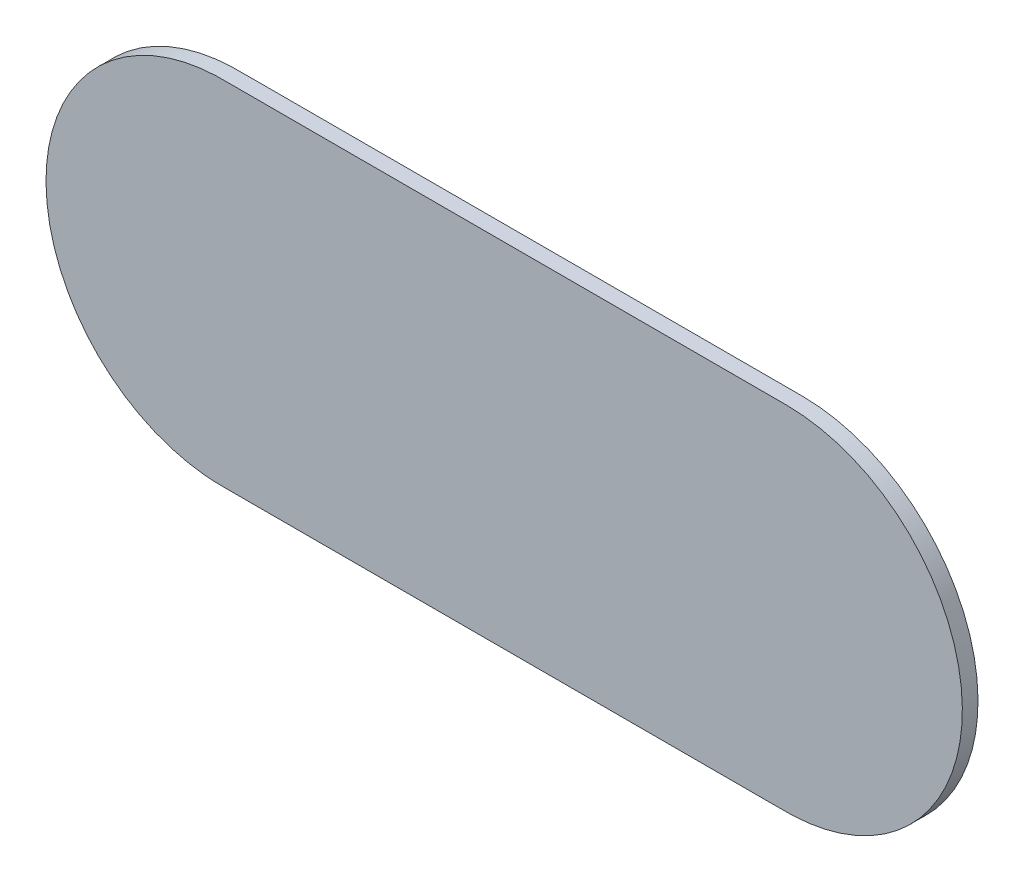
ISO-10303-21;
HEADER;
FILE_DESCRIPTION(('STEP AP214'),'2;1');
FILE_NAME('part.step','',(''),(''),'','','');
FILE_SCHEMA(('AUTOMOTIVE_DESIGN { 1 0 10303 214 1 1 1 1 }'));
ENDSEC;
DATA;
#1=APPLICATION_CONTEXT('core data for automotive mechanical design processes');
#2=APPLICATION_PROTOCOL_DEFINITION('international standard','automotive_design',2000,#1);
#3=PRODUCT_CONTEXT('',#1,'mechanical');
#4=PRODUCT('Part','Part','',(#3));
#5=PRODUCT_RELATED_PRODUCT_CATEGORY('part','',(#4));
#6=PRODUCT_DEFINITION_FORMATION('','',#4);
#7=PRODUCT_DEFINITION_CONTEXT('part definition',#1,'design');
#8=PRODUCT_DEFINITION('design','',#6,#7);
#9=PRODUCT_DEFINITION_SHAPE('','',#8);
#10=(LENGTH_UNIT() NAMED_UNIT(*) SI_UNIT(.MILLI.,.METRE.));
#11=(NAMED_UNIT(*) PLANE_ANGLE_UNIT() SI_UNIT($,.RADIAN.));
#12=(NAMED_UNIT(*) SI_UNIT($,.STERADIAN.) SOLID_ANGLE_UNIT());
#13=UNCERTAINTY_MEASURE_WITH_UNIT(LENGTH_MEASURE(1.E-05),#10,'distance_accuracy_value','');
#14=(GEOMETRIC_REPRESENTATION_CONTEXT(3) GLOBAL_UNCERTAINTY_ASSIGNED_CONTEXT((#13)) GLOBAL_UNIT_ASSIGNED_CONTEXT((#10,
#11,#12)) REPRESENTATION_CONTEXT('',''));
#15=CARTESIAN_POINT('',(0.,0.,0.));
#16=DIRECTION('',(0.,0.,1.));
#17=DIRECTION('',(1.,0.,0.));
#18=AXIS2_PLACEMENT_3D('',#15,#16,#17);
#19=CARTESIAN_POINT('',(457.2,0.,0.));
#20=DIRECTION('',(0.,0.,1.));
#21=DIRECTION('',(1.,0.,0.));
#22=AXIS2_PLACEMENT_3D('',#19,#20,#21);
#23=PLANE('',#22);
#24=CARTESIAN_POINT('',(0.659988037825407,-142.875,0.));
#25=CARTESIAN_POINT('',(152.619996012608,-142.875,0.));
#26=CARTESIAN_POINT('',(304.580003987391,-142.875,0.));
#27=CARTESIAN_POINT('',(456.540011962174,-142.875,0.));
#28=CARTESIAN_POINT('',(456.613343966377,-142.875,0.));
#29=CARTESIAN_POINT('',(456.760007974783,-142.875,0.));
#30=CARTESIAN_POINT('',(456.980003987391,-142.875,0.));
#31=CARTESIAN_POINT('',(457.126667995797,-142.875,0.));
#32=CARTESIAN_POINT('',(457.2,-142.875,0.));
#33=CARTESIAN_POINT('',(457.27199346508,-142.875,0.));
#34=CARTESIAN_POINT('',(457.41598039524,-142.875,0.));
#35=CARTESIAN_POINT('',(457.631960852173,-142.874401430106,0.));
#36=CARTESIAN_POINT('',(457.775946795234,-142.873857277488,0.));
#37=CARTESIAN_POINT('',(457.84793951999,-142.873530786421,0.));
#38=CARTESIAN_POINT('',(741.023653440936,-141.589312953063,0.));
#39=CARTESIAN_POINT('',(741.023653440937,141.589312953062,0.));
#40=CARTESIAN_POINT('',(457.84793951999,142.873530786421,0.));
#41=CARTESIAN_POINT('',(457.775946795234,142.873857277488,0.));
#42=CARTESIAN_POINT('',(457.631960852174,142.874401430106,0.));
#43=CARTESIAN_POINT('',(457.41598039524,142.875,0.));
#44=CARTESIAN_POINT('',(457.27199346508,142.875,0.));
#45=CARTESIAN_POINT('',(457.2,142.875,0.));
#46=CARTESIAN_POINT('',(457.126667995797,142.875,0.));
#47=CARTESIAN_POINT('',(456.980003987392,142.875,0.));
#48=CARTESIAN_POINT('',(456.760007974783,142.875,0.));
#49=CARTESIAN_POINT('',(456.613343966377,142.875,0.));
#50=CARTESIAN_POINT('',(456.540011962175,142.875,0.));
#51=CARTESIAN_POINT('',(304.580003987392,142.875,0.));
#52=CARTESIAN_POINT('',(152.619996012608,142.875,0.));
#53=CARTESIAN_POINT('',(0.65998803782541,142.875,0.));
#54=CARTESIAN_POINT('',(0.586656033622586,142.875,0.));
#55=CARTESIAN_POINT('',(0.43999202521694,142.875,0.));
#56=CARTESIAN_POINT('',(0.21999601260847,142.875,0.));
#57=CARTESIAN_POINT('',(0.073332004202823,142.875,0.));
#58=CARTESIAN_POINT('',(0.,142.875,0.));
#59=CARTESIAN_POINT('',(-0.0719934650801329,142.875,0.));
#60=CARTESIAN_POINT('',(-0.215980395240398,142.875,0.));
#61=CARTESIAN_POINT('',(-0.431960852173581,142.874401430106,0.));
#62=CARTESIAN_POINT('',(-0.575946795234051,142.873857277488,0.));
#63=CARTESIAN_POINT('',(-0.647939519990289,142.873530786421,0.));
#64=CARTESIAN_POINT('',(-283.823653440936,141.589312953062,0.));
#65=CARTESIAN_POINT('',(-283.823653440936,-141.589312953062,0.));
#66=CARTESIAN_POINT('',(-0.647939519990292,-142.873530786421,0.));
#67=CARTESIAN_POINT('',(-0.575946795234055,-142.873857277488,0.));
#68=CARTESIAN_POINT('',(-0.431960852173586,-142.874401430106,0.));
#69=CARTESIAN_POINT('',(-0.215980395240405,-142.875,0.));
#70=CARTESIAN_POINT('',(-0.0719934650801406,-142.875,0.));
#71=CARTESIAN_POINT('',(0.,-142.875,0.));
#72=CARTESIAN_POINT('',(0.0733320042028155,-142.875,0.));
#73=CARTESIAN_POINT('',(0.219996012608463,-142.875,0.));
#74=CARTESIAN_POINT('',(0.439992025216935,-142.875,0.));
#75=CARTESIAN_POINT('',(0.586656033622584,-142.875,0.));
#76=CARTESIAN_POINT('',(0.659988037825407,-142.875,0.));
#77=(BOUNDED_CURVE() B_SPLINE_CURVE(3,(#24,#25,#26,#27,#28,#29,#30,#31,#32,#33,#34,#35,#36,#37,
#38,#39,#40,#41,#42,#43,#44,#45,#46,#47,#48,#49,#50,#51,#52,#53,#54,#55,#56,#57,#58,#59,#60,#61,
#62,#63,#64,#65,#66,#67,#68,#69,#70,#71,#72,#73,#74,#75,#76),.UNSPECIFIED.,.T.,
.F.) B_SPLINE_CURVE_WITH_KNOTS((4,3,1,1,3,1,1,3,3,1,1,3,1,1,3,3,1,1,3,1,1,3,3,1,1,3,1,1,4),(0.,
0.306270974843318,0.306418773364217,0.306566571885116,0.306714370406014,0.306859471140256,
0.307004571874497,0.307149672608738,0.499121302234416,0.499266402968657,0.499411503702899,
0.49955660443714,0.499704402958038,0.499852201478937,0.499999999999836,0.806270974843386,
0.806418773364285,0.806566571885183,0.806714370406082,0.806859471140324,0.807004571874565,
0.807149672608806,0.99912130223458,0.999266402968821,0.999411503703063,0.999556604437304,
0.999704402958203,0.999852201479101,1.),
.UNSPECIFIED.) CURVE() GEOMETRIC_REPRESENTATION_ITEM() RATIONAL_B_SPLINE_CURVE((1.,1.,1.,1.,1.,
1.,1.,1.,1.,1.,1.,1.,1.,1.,0.336356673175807,0.336356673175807,1.,1.,1.,1.,1.,1.,1.,1.,1.,1.,1.,
1.,1.,1.,1.,1.,1.,1.,1.,1.,1.,1.,1.,1.,0.336356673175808,0.336356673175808,1.,1.,1.,1.,1.,1.,1.,
1.,1.,1.,1.)) REPRESENTATION_ITEM(''));
#78=CARTESIAN_POINT('',(0.659988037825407,-142.875,0.));
#79=VERTEX_POINT('',#78);
#80=EDGE_CURVE('E11',#79,#79,#77,.F.);
#81=ORIENTED_EDGE('',*,*,#80,.F.);
#82=EDGE_LOOP('',(#81));
#83=FACE_BOUND('',#82,.T.);
#84=ADVANCED_FACE('F31',(#83),#23,.T.);
#85=CARTESIAN_POINT('',(0.659988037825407,-142.875,2.54));
#86=CARTESIAN_POINT('',(152.619996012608,-142.875,2.54));
#87=CARTESIAN_POINT('',(304.580003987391,-142.875,2.54));
#88=CARTESIAN_POINT('',(456.540011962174,-142.875,2.54));
#89=CARTESIAN_POINT('',(456.613343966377,-142.875,2.54));
#90=CARTESIAN_POINT('',(456.760007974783,-142.875,2.54));
#91=CARTESIAN_POINT('',(456.980003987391,-142.875,2.54));
#92=CARTESIAN_POINT('',(457.126667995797,-142.875,2.54));
#93=CARTESIAN_POINT('',(457.2,-142.875,2.54));
#94=CARTESIAN_POINT('',(457.27199346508,-142.875,2.54));
#95=CARTESIAN_POINT('',(457.41598039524,-142.875,2.54));
#96=CARTESIAN_POINT('',(457.631960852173,-142.874401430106,2.54));
#97=CARTESIAN_POINT('',(457.775946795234,-142.873857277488,2.54));
#98=CARTESIAN_POINT('',(457.84793951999,-142.873530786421,2.54));
#99=CARTESIAN_POINT('',(741.023653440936,-141.589312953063,2.54));
#100=CARTESIAN_POINT('',(741.023653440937,141.589312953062,2.54));
#101=CARTESIAN_POINT('',(457.84793951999,142.873530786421,2.54));
#102=CARTESIAN_POINT('',(457.775946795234,142.873857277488,2.54));
#103=CARTESIAN_POINT('',(457.631960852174,142.874401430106,2.54));
#104=CARTESIAN_POINT('',(457.41598039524,142.875,2.54));
#105=CARTESIAN_POINT('',(457.27199346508,142.875,2.54));
#106=CARTESIAN_POINT('',(457.2,142.875,2.54));
#107=CARTESIAN_POINT('',(457.126667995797,142.875,2.54));
#108=CARTESIAN_POINT('',(456.980003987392,142.875,2.54));
#109=CARTESIAN_POINT('',(456.760007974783,142.875,2.54));
#110=CARTESIAN_POINT('',(456.613343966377,142.875,2.54));
#111=CARTESIAN_POINT('',(456.540011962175,142.875,2.54));
#112=CARTESIAN_POINT('',(304.580003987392,142.875,2.54));
#113=CARTESIAN_POINT('',(152.619996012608,142.875,2.54));
#114=CARTESIAN_POINT('',(0.65998803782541,142.875,2.54));
#115=CARTESIAN_POINT('',(0.586656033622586,142.875,2.54));
#116=CARTESIAN_POINT('',(0.43999202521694,142.875,2.54));
#117=CARTESIAN_POINT('',(0.21999601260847,142.875,2.54));
#118=CARTESIAN_POINT('',(0.073332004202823,142.875,2.54));
#119=CARTESIAN_POINT('',(0.,142.875,2.54));
#120=CARTESIAN_POINT('',(-0.0719934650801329,142.875,2.54));
#121=CARTESIAN_POINT('',(-0.215980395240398,142.875,2.54));
#122=CARTESIAN_POINT('',(-0.431960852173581,142.874401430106,2.54));
#123=CARTESIAN_POINT('',(-0.575946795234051,142.873857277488,2.54));
#124=CARTESIAN_POINT('',(-0.647939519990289,142.873530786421,2.54));
#125=CARTESIAN_POINT('',(-283.823653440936,141.589312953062,2.54));
#126=CARTESIAN_POINT('',(-283.823653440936,-141.589312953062,2.54));
#127=CARTESIAN_POINT('',(-0.647939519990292,-142.873530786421,2.54));
#128=CARTESIAN_POINT('',(-0.575946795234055,-142.873857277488,2.54));
#129=CARTESIAN_POINT('',(-0.431960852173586,-142.874401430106,2.54));
#130=CARTESIAN_POINT('',(-0.215980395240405,-142.875,2.54));
#131=CARTESIAN_POINT('',(-0.0719934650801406,-142.875,2.54));
#132=CARTESIAN_POINT('',(0.,-142.875,2.54));
#133=CARTESIAN_POINT('',(0.0733320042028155,-142.875,2.54));
#134=CARTESIAN_POINT('',(0.219996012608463,-142.875,2.54));
#135=CARTESIAN_POINT('',(0.439992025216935,-142.875,2.54));
#136=CARTESIAN_POINT('',(0.586656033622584,-142.875,2.54));
#137=CARTESIAN_POINT('',(0.659988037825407,-142.875,2.54));
#138=(BOUNDED_CURVE() B_SPLINE_CURVE(3,(#85,#86,#87,#88,#89,#90,#91,#92,#93,#94,#95,#96,#97,#98,
#99,#100,#101,#102,#103,#104,#105,#106,#107,#108,#109,#110,#111,#112,#113,#114,#115,#116,#117,
#118,#119,#120,#121,#122,#123,#124,#125,#126,#127,#128,#129,#130,#131,#132,#133,#134,#135,#136,
#137),.UNSPECIFIED.,.T.,.F.) B_SPLINE_CURVE_WITH_KNOTS((4,3,1,1,3,1,1,3,3,1,1,3,1,1,3,3,1,1,3,1,
1,3,3,1,1,3,1,1,4),(0.,0.306270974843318,0.306418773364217,0.306566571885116,0.306714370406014,
0.306859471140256,0.307004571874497,0.307149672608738,0.499121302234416,0.499266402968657,
0.499411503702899,0.49955660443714,0.499704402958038,0.499852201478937,0.499999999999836,
0.806270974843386,0.806418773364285,0.806566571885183,0.806714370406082,0.806859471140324,
0.807004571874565,0.807149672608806,0.99912130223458,0.999266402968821,0.999411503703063,
0.999556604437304,0.999704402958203,0.999852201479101,1.),
.UNSPECIFIED.) CURVE() GEOMETRIC_REPRESENTATION_ITEM() RATIONAL_B_SPLINE_CURVE((1.,1.,1.,1.,1.,
1.,1.,1.,1.,1.,1.,1.,1.,1.,0.336356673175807,0.336356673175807,1.,1.,1.,1.,1.,1.,1.,1.,1.,1.,1.,
1.,1.,1.,1.,1.,1.,1.,1.,1.,1.,1.,1.,1.,0.336356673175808,0.336356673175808,1.,1.,1.,1.,1.,1.,1.,
1.,1.,1.,1.)) REPRESENTATION_ITEM(''));
#139=DIRECTION('',(0.,0.,-1.));
#140=VECTOR('',#139,1.);
#141=SURFACE_OF_LINEAR_EXTRUSION('',#138,#140);
#142=ORIENTED_EDGE('',*,*,#80,.T.);
#143=EDGE_LOOP('',(#142));
#144=FACE_BOUND('',#143,.T.);
#145=CARTESIAN_POINT('',(0.659988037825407,-142.875,-12.7));
#146=CARTESIAN_POINT('',(152.619996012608,-142.875,-12.7));
#147=CARTESIAN_POINT('',(304.580003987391,-142.875,-12.7));
#148=CARTESIAN_POINT('',(456.540011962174,-142.875,-12.7));
#149=CARTESIAN_POINT('',(456.613343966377,-142.875,-12.7));
#150=CARTESIAN_POINT('',(456.760007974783,-142.875,-12.7));
#151=CARTESIAN_POINT('',(456.980003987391,-142.875,-12.7));
#152=CARTESIAN_POINT('',(457.126667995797,-142.875,-12.7));
#153=CARTESIAN_POINT('',(457.2,-142.875,-12.7));
#154=CARTESIAN_POINT('',(457.27199346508,-142.875,-12.7));
#155=CARTESIAN_POINT('',(457.41598039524,-142.875,-12.7));
#156=CARTESIAN_POINT('',(457.631960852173,-142.874401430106,-12.7));
#157=CARTESIAN_POINT('',(457.775946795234,-142.873857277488,-12.7));
#158=CARTESIAN_POINT('',(457.84793951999,-142.873530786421,-12.7));
#159=CARTESIAN_POINT('',(741.023653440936,-141.589312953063,-12.7));
#160=CARTESIAN_POINT('',(741.023653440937,141.589312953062,-12.7));
#161=CARTESIAN_POINT('',(457.84793951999,142.873530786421,-12.7));
#162=CARTESIAN_POINT('',(457.775946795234,142.873857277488,-12.7));
#163=CARTESIAN_POINT('',(457.631960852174,142.874401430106,-12.7));
#164=CARTESIAN_POINT('',(457.41598039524,142.875,-12.7));
#165=CARTESIAN_POINT('',(457.27199346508,142.875,-12.7));
#166=CARTESIAN_POINT('',(457.2,142.875,-12.7));
#167=CARTESIAN_POINT('',(457.126667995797,142.875,-12.7));
#168=CARTESIAN_POINT('',(456.980003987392,142.875,-12.7));
#169=CARTESIAN_POINT('',(456.760007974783,142.875,-12.7));
#170=CARTESIAN_POINT('',(456.613343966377,142.875,-12.7));
#171=CARTESIAN_POINT('',(456.540011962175,142.875,-12.7));
#172=CARTESIAN_POINT('',(304.580003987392,142.875,-12.7));
#173=CARTESIAN_POINT('',(152.619996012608,142.875,-12.7));
#174=CARTESIAN_POINT('',(0.65998803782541,142.875,-12.7));
#175=CARTESIAN_POINT('',(0.586656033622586,142.875,-12.7));
#176=CARTESIAN_POINT('',(0.43999202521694,142.875,-12.7));
#177=CARTESIAN_POINT('',(0.21999601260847,142.875,-12.7));
#178=CARTESIAN_POINT('',(0.073332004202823,142.875,-12.7));
#179=CARTESIAN_POINT('',(0.,142.875,-12.7));
#180=CARTESIAN_POINT('',(-0.0719934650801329,142.875,-12.7));
#181=CARTESIAN_POINT('',(-0.215980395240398,142.875,-12.7));
#182=CARTESIAN_POINT('',(-0.431960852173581,142.874401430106,-12.7));
#183=CARTESIAN_POINT('',(-0.575946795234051,142.873857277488,-12.7));
#184=CARTESIAN_POINT('',(-0.647939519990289,142.873530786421,-12.7));
#185=CARTESIAN_POINT('',(-283.823653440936,141.589312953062,-12.7));
#186=CARTESIAN_POINT('',(-283.823653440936,-141.589312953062,-12.7));
#187=CARTESIAN_POINT('',(-0.647939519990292,-142.873530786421,-12.7));
#188=CARTESIAN_POINT('',(-0.575946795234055,-142.873857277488,-12.7));
#189=CARTESIAN_POINT('',(-0.431960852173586,-142.874401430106,-12.7));
#190=CARTESIAN_POINT('',(-0.215980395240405,-142.875,-12.7));
#191=CARTESIAN_POINT('',(-0.0719934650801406,-142.875,-12.7));
#192=CARTESIAN_POINT('',(0.,-142.875,-12.7));
#193=CARTESIAN_POINT('',(0.0733320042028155,-142.875,-12.7));
#194=CARTESIAN_POINT('',(0.219996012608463,-142.875,-12.7));
#195=CARTESIAN_POINT('',(0.439992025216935,-142.875,-12.7));
#196=CARTESIAN_POINT('',(0.586656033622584,-142.875,-12.7));
#197=CARTESIAN_POINT('',(0.659988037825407,-142.875,-12.7));
#198=(BOUNDED_CURVE() B_SPLINE_CURVE(3,(#145,#146,#147,#148,#149,#150,#151,#152,#153,#154,#155,
#156,#157,#158,#159,#160,#161,#162,#163,#164,#165,#166,#167,#168,#169,#170,#171,#172,#173,#174,
#175,#176,#177,#178,#179,#180,#181,#182,#183,#184,#185,#186,#187,#188,#189,#190,#191,#192,#193,
#194,#195,#196,#197),.UNSPECIFIED.,.T.,.F.) B_SPLINE_CURVE_WITH_KNOTS((4,3,1,1,3,1,1,3,3,1,1,3,
1,1,3,3,1,1,3,1,1,3,3,1,1,3,1,1,4),(0.,0.306270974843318,0.306418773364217,0.306566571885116,
0.306714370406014,0.306859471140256,0.307004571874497,0.307149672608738,0.499121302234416,
0.499266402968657,0.499411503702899,0.49955660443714,0.499704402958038,0.499852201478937,
0.499999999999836,0.806270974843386,0.806418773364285,0.806566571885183,0.806714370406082,
0.806859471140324,0.807004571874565,0.807149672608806,0.99912130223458,0.999266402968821,
0.999411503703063,0.999556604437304,0.999704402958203,0.999852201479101,1.),
.UNSPECIFIED.) CURVE() GEOMETRIC_REPRESENTATION_ITEM() RATIONAL_B_SPLINE_CURVE((1.,1.,1.,1.,1.,
1.,1.,1.,1.,1.,1.,1.,1.,1.,0.336356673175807,0.336356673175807,1.,1.,1.,1.,1.,1.,1.,1.,1.,1.,1.,
1.,1.,1.,1.,1.,1.,1.,1.,1.,1.,1.,1.,1.,0.336356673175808,0.336356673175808,1.,1.,1.,1.,1.,1.,1.,
1.,1.,1.,1.)) REPRESENTATION_ITEM(''));
#199=CARTESIAN_POINT('',(0.659988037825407,-142.875,-12.7));
#200=VERTEX_POINT('',#199);
#201=EDGE_CURVE('E39',#200,#200,#198,.T.);
#202=ORIENTED_EDGE('',*,*,#201,.T.);
#203=EDGE_LOOP('',(#202));
#204=FACE_BOUND('',#203,.T.);
#205=ADVANCED_FACE('F58',(#144,#204),#141,.F.);
#206=CARTESIAN_POINT('',(457.2,0.,-12.7));
#207=DIRECTION('',(0.,0.,1.));
#208=DIRECTION('',(1.,0.,0.));
#209=AXIS2_PLACEMENT_3D('',#206,#207,#208);
#210=PLANE('',#209);
#211=ORIENTED_EDGE('',*,*,#201,.F.);
#212=EDGE_LOOP('',(#211));
#213=FACE_BOUND('',#212,.T.);
#214=ADVANCED_FACE('F60',(#213),#210,.F.);
#215=CLOSED_SHELL('',(#84,#205,#214));
#216=MANIFOLD_SOLID_BREP('B2',#215);
#217=ADVANCED_BREP_SHAPE_REPRESENTATION('',(#18,#216),#14);
#218=SHAPE_DEFINITION_REPRESENTATION(#9,#217);
ENDSEC;
END-ISO-10303-21;
